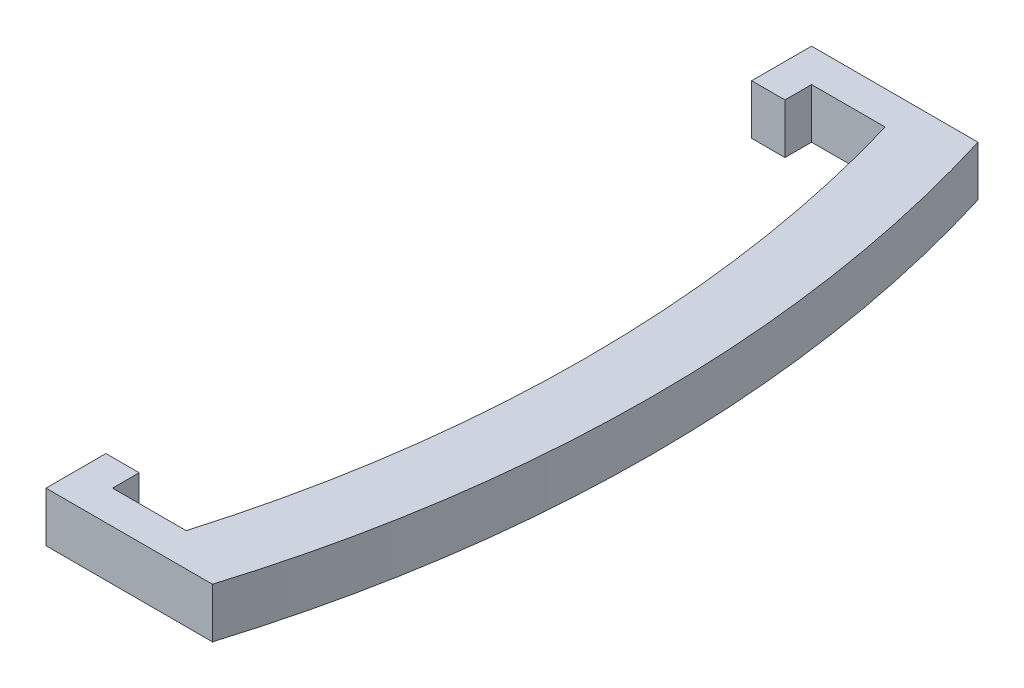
from build123d import *

# Parameters (mm, degrees)
EXTRUSION2_DEPTH = 1.5


with BuildPart() as part:
    # Esquisse7 → Extrusion2 (new body)
    with BuildSketch(Plane(origin=(0, 0, 0), x_dir=(1, 0, 0), z_dir=(0, 1, 0))):
        with BuildLine():
            Line((79.995651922, 31.9), (79.995651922, 30.1))
            Line((79.995651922, 30.1), (80.995651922, 30.1))
            Line((80.995651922, 30.1), (80.995651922, 30.9))
            Line((80.995651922, 30.9), (83.20781646, 30.9))
            ThreePointArc((83.20781646, 30.9), (84.72, 20.4), (83.20781646, 9.9))
            Line((83.20781646, 9.9), (80.995651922, 9.9))
            Line((80.995651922, 9.9), (80.995651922, 10.7))
            Line((80.995651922, 10.7), (79.995651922, 10.7))
            Line((79.995651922, 10.7), (79.995651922, 8.9))
            Line((79.995651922, 8.9), (84.995651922, 8.9))
            ThreePointArc((84.995651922, 8.9), (86.72, 20.4), (84.995651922, 31.9))
            Line((84.995651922, 31.9), (79.995651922, 31.9))
        make_face()
    extrude(amount=-EXTRUSION2_DEPTH)


solid = part.part
